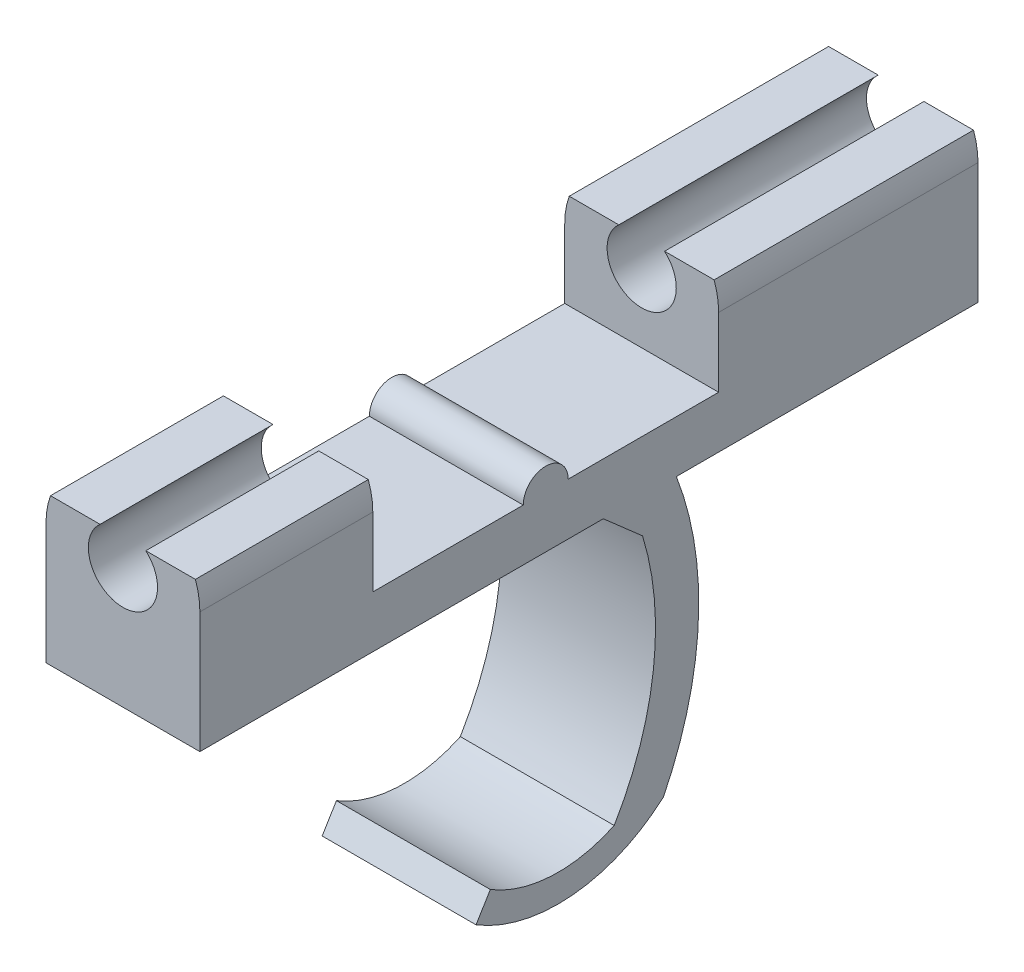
ISO-10303-21;
HEADER;
FILE_DESCRIPTION(('STEP AP214'),'2;1');
FILE_NAME('part.step','',(''),(''),'','','');
FILE_SCHEMA(('AUTOMOTIVE_DESIGN { 1 0 10303 214 1 1 1 1 }'));
ENDSEC;
DATA;
#1=APPLICATION_CONTEXT('core data for automotive mechanical design processes');
#2=APPLICATION_PROTOCOL_DEFINITION('international standard','automotive_design',2000,#1);
#3=PRODUCT_CONTEXT('',#1,'mechanical');
#4=PRODUCT('Part','Part','',(#3));
#5=PRODUCT_RELATED_PRODUCT_CATEGORY('part','',(#4));
#6=PRODUCT_DEFINITION_FORMATION('','',#4);
#7=PRODUCT_DEFINITION_CONTEXT('part definition',#1,'design');
#8=PRODUCT_DEFINITION('design','',#6,#7);
#9=PRODUCT_DEFINITION_SHAPE('','',#8);
#10=(LENGTH_UNIT() NAMED_UNIT(*) SI_UNIT(.MILLI.,.METRE.));
#11=(NAMED_UNIT(*) PLANE_ANGLE_UNIT() SI_UNIT($,.RADIAN.));
#12=(NAMED_UNIT(*) SI_UNIT($,.STERADIAN.) SOLID_ANGLE_UNIT());
#13=UNCERTAINTY_MEASURE_WITH_UNIT(LENGTH_MEASURE(1.E-05),#10,'distance_accuracy_value','');
#14=(GEOMETRIC_REPRESENTATION_CONTEXT(3) GLOBAL_UNCERTAINTY_ASSIGNED_CONTEXT((#13)) GLOBAL_UNIT_ASSIGNED_CONTEXT((#10,
#11,#12)) REPRESENTATION_CONTEXT('',''));
#15=CARTESIAN_POINT('',(0.,0.,0.));
#16=DIRECTION('',(0.,0.,1.));
#17=DIRECTION('',(1.,0.,0.));
#18=AXIS2_PLACEMENT_3D('',#15,#16,#17);
#19=CARTESIAN_POINT('',(-4.45,1.3,45.));
#20=DIRECTION('',(0.,-1.,0.));
#21=DIRECTION('',(0.,0.,-1.));
#22=AXIS2_PLACEMENT_3D('',#19,#20,#21);
#23=PLANE('',#22);
#24=DIRECTION('',(1.,0.,0.));
#25=VECTOR('',#24,1.);
#26=CARTESIAN_POINT('',(-4.45,1.3,15.));
#27=LINE('',#26,#25);
#28=CARTESIAN_POINT('',(-4.45,1.3,15.));
#29=VERTEX_POINT('',#28);
#30=CARTESIAN_POINT('',(4.45,1.3,15.));
#31=VERTEX_POINT('',#30);
#32=EDGE_CURVE('E294',#29,#31,#27,.T.);
#33=ORIENTED_EDGE('',*,*,#32,.F.);
#34=DIRECTION('',(0.,0.,-1.));
#35=VECTOR('',#34,1.);
#36=CARTESIAN_POINT('',(-4.45,1.3,45.));
#37=LINE('',#36,#35);
#38=CARTESIAN_POINT('',(-4.45,1.3,23.7));
#39=VERTEX_POINT('',#38);
#40=EDGE_CURVE('E217',#39,#29,#37,.T.);
#41=ORIENTED_EDGE('',*,*,#40,.F.);
#42=DIRECTION('',(1.,0.,0.));
#43=VECTOR('',#42,1.);
#44=CARTESIAN_POINT('',(-8.12695526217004,1.3,23.7));
#45=LINE('',#44,#43);
#46=CARTESIAN_POINT('',(4.45,1.3,23.7));
#47=VERTEX_POINT('',#46);
#48=EDGE_CURVE('E374',#39,#47,#45,.T.);
#49=ORIENTED_EDGE('',*,*,#48,.T.);
#50=DIRECTION('',(0.,0.,-1.));
#51=VECTOR('',#50,1.);
#52=CARTESIAN_POINT('',(4.45,1.3,45.));
#53=LINE('',#52,#51);
#54=EDGE_CURVE('E383',#47,#31,#53,.T.);
#55=ORIENTED_EDGE('',*,*,#54,.T.);
#56=EDGE_LOOP('',(#33,#41,#49,#55));
#57=FACE_BOUND('',#56,.T.);
#58=ADVANCED_FACE('F43',(#57),#23,.F.);
#59=DIRECTION('',(-1.,0.,0.));
#60=VECTOR('',#59,1.);
#61=CARTESIAN_POINT('',(-4.45,1.3,35.));
#62=LINE('',#61,#60);
#63=CARTESIAN_POINT('',(4.45,1.3,35.));
#64=VERTEX_POINT('',#63);
#65=CARTESIAN_POINT('',(-4.45,1.3,35.));
#66=VERTEX_POINT('',#65);
#67=EDGE_CURVE('E332',#64,#66,#62,.T.);
#68=ORIENTED_EDGE('',*,*,#67,.F.);
#69=CARTESIAN_POINT('',(4.45,1.3,26.3));
#70=VERTEX_POINT('',#69);
#71=EDGE_CURVE('E51',#64,#70,#53,.T.);
#72=ORIENTED_EDGE('',*,*,#71,.T.);
#73=DIRECTION('',(1.,0.,0.));
#74=VECTOR('',#73,1.);
#75=CARTESIAN_POINT('',(-8.12695526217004,1.3,26.3));
#76=LINE('',#75,#74);
#77=CARTESIAN_POINT('',(-4.45,1.3,26.3));
#78=VERTEX_POINT('',#77);
#79=EDGE_CURVE('E371',#70,#78,#76,.F.);
#80=ORIENTED_EDGE('',*,*,#79,.T.);
#81=EDGE_CURVE('E382',#66,#78,#37,.T.);
#82=ORIENTED_EDGE('',*,*,#81,.F.);
#83=EDGE_LOOP('',(#68,#72,#80,#82));
#84=FACE_BOUND('',#83,.T.);
#85=ADVANCED_FACE('F412',(#84),#23,.F.);
#86=CARTESIAN_POINT('',(4.45,1.3,45.));
#87=DIRECTION('',(-1.,0.,0.));
#88=DIRECTION('',(0.,0.,1.));
#89=AXIS2_PLACEMENT_3D('',#86,#87,#88);
#90=PLANE('',#89);
#91=CARTESIAN_POINT('',(4.45,-8.68882702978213,35.65));
#92=DIRECTION('',(1.,0.,0.));
#93=DIRECTION('',(0.,0.,-1.));
#94=AXIS2_PLACEMENT_3D('',#91,#92,#93);
#95=CIRCLE('',#94,19.5);
#96=CARTESIAN_POINT('',(4.45,-17.3776540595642,18.1927870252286));
#97=VERTEX_POINT('',#96);
#98=CARTESIAN_POINT('',(4.45,-1.7,17.4454319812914));
#99=VERTEX_POINT('',#98);
#100=EDGE_CURVE('E346',#97,#99,#95,.T.);
#101=ORIENTED_EDGE('',*,*,#100,.T.);
#102=DIRECTION('',(0.,0.,1.));
#103=VECTOR('',#102,1.);
#104=CARTESIAN_POINT('',(4.45,-1.7,0.));
#105=LINE('',#104,#103);
#106=CARTESIAN_POINT('',(4.45,-1.7,0.));
#107=VERTEX_POINT('',#106);
#108=EDGE_CURVE('E236',#107,#99,#105,.T.);
#109=ORIENTED_EDGE('',*,*,#108,.F.);
#110=DIRECTION('',(0.,1.,0.));
#111=VECTOR('',#110,1.);
#112=CARTESIAN_POINT('',(4.45,1.3,0.));
#113=LINE('',#112,#111);
#114=CARTESIAN_POINT('',(4.45,5.3,0.));
#115=VERTEX_POINT('',#114);
#116=EDGE_CURVE('E377',#107,#115,#113,.T.);
#117=ORIENTED_EDGE('',*,*,#116,.T.);
#118=DIRECTION('',(0.,0.,-1.));
#119=VECTOR('',#118,1.);
#120=CARTESIAN_POINT('',(4.45,5.3,15.));
#121=LINE('',#120,#119);
#122=CARTESIAN_POINT('',(4.45,5.3,15.));
#123=VERTEX_POINT('',#122);
#124=EDGE_CURVE('E291',#123,#115,#121,.T.);
#125=ORIENTED_EDGE('',*,*,#124,.F.);
#126=DIRECTION('',(0.,1.,0.));
#127=VECTOR('',#126,1.);
#128=CARTESIAN_POINT('',(4.45,0.,15.));
#129=LINE('',#128,#127);
#130=EDGE_CURVE('E288',#31,#123,#129,.T.);
#131=ORIENTED_EDGE('',*,*,#130,.F.);
#132=ORIENTED_EDGE('',*,*,#54,.F.);
#133=CARTESIAN_POINT('',(4.45,1.3,25.));
#134=DIRECTION('',(1.,0.,0.));
#135=DIRECTION('',(0.,0.,-1.));
#136=AXIS2_PLACEMENT_3D('',#133,#134,#135);
#137=CIRCLE('',#136,1.3);
#138=EDGE_CURVE('E366',#47,#70,#137,.T.);
#139=ORIENTED_EDGE('',*,*,#138,.T.);
#140=ORIENTED_EDGE('',*,*,#71,.F.);
#141=DIRECTION('',(0.,1.,0.));
#142=VECTOR('',#141,1.);
#143=CARTESIAN_POINT('',(4.45,0.,35.));
#144=LINE('',#143,#142);
#145=CARTESIAN_POINT('',(4.45,5.3,35.));
#146=VERTEX_POINT('',#145);
#147=EDGE_CURVE('E307',#64,#146,#144,.T.);
#148=ORIENTED_EDGE('',*,*,#147,.T.);
#149=DIRECTION('',(0.,0.,1.));
#150=VECTOR('',#149,1.);
#151=CARTESIAN_POINT('',(4.45,5.3,35.));
#152=LINE('',#151,#150);
#153=CARTESIAN_POINT('',(4.45,5.3,45.));
#154=VERTEX_POINT('',#153);
#155=EDGE_CURVE('E321',#146,#154,#152,.T.);
#156=ORIENTED_EDGE('',*,*,#155,.T.);
#157=DIRECTION('',(0.,1.,0.));
#158=VECTOR('',#157,1.);
#159=CARTESIAN_POINT('',(4.45,1.3,45.));
#160=LINE('',#159,#158);
#161=CARTESIAN_POINT('',(4.45,-1.7,45.));
#162=VERTEX_POINT('',#161);
#163=EDGE_CURVE('E218',#162,#154,#160,.T.);
#164=ORIENTED_EDGE('',*,*,#163,.F.);
#165=CARTESIAN_POINT('',(4.45,-1.7,21.6701921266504));
#166=VERTEX_POINT('',#165);
#167=EDGE_CURVE('E230',#166,#162,#105,.T.);
#168=ORIENTED_EDGE('',*,*,#167,.F.);
#169=DIRECTION('',(0.,0.659518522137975,0.751688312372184));
#170=VECTOR('',#169,1.);
#171=CARTESIAN_POINT('',(4.45,-11.7036090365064,10.2685472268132));
#172=LINE('',#171,#170);
#173=CARTESIAN_POINT('',(4.45,-3.6906262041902,19.401369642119));
#174=VERTEX_POINT('',#173);
#175=EDGE_CURVE('E353',#174,#166,#172,.T.);
#176=ORIENTED_EDGE('',*,*,#175,.F.);
#177=CARTESIAN_POINT('',(4.45,-8.68882702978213,35.65));
#178=DIRECTION('',(1.,0.,0.));
#179=DIRECTION('',(0.,0.,-1.));
#180=AXIS2_PLACEMENT_3D('',#177,#178,#179);
#181=CIRCLE('',#180,17.);
#182=CARTESIAN_POINT('',(4.45,-17.3776540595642,21.0382141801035));
#183=VERTEX_POINT('',#182);
#184=EDGE_CURVE('E356',#183,#174,#181,.T.);
#185=ORIENTED_EDGE('',*,*,#184,.F.);
#186=CARTESIAN_POINT('',(4.45,-10.556501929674,24.2732126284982));
#187=DIRECTION('',(1.,0.,0.));
#188=DIRECTION('',(0.,0.,-1.));
#189=AXIS2_PLACEMENT_3D('',#186,#187,#188);
#190=CIRCLE('',#189,7.5493927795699);
#191=CARTESIAN_POINT('',(4.45,-17.0023963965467,28.2030696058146));
#192=VERTEX_POINT('',#191);
#193=EDGE_CURVE('E269',#192,#183,#190,.T.);
#194=ORIENTED_EDGE('',*,*,#193,.F.);
#195=DIRECTION('',(0.,-0.853829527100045,0.520552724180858));
#196=VECTOR('',#195,1.);
#197=CARTESIAN_POINT('',(4.45,7.92800228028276,13.0037979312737));
#198=LINE('',#197,#196);
#199=CARTESIAN_POINT('',(4.45,-18.3586395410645,29.0299279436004));
#200=VERTEX_POINT('',#199);
#201=EDGE_CURVE('E245',#192,#200,#198,.T.);
#202=ORIENTED_EDGE('',*,*,#201,.T.);
#203=CARTESIAN_POINT('',(4.45,-10.556501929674,24.2732126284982));
#204=DIRECTION('',(1.,0.,0.));
#205=DIRECTION('',(0.,0.,-1.));
#206=AXIS2_PLACEMENT_3D('',#203,#204,#205);
#207=CIRCLE('',#206,9.13781658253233);
#208=EDGE_CURVE('E266',#200,#97,#207,.T.);
#209=ORIENTED_EDGE('',*,*,#208,.T.);
#210=EDGE_LOOP('',(#101,#109,#117,#125,#131,#132,#139,#140,#148,#156,#164,#168,#176,#185,#194,
#202,#209));
#211=FACE_BOUND('',#210,.T.);
#212=ADVANCED_FACE('F45',(#211),#90,.F.);
#213=CARTESIAN_POINT('',(-4.45,0.,45.));
#214=DIRECTION('',(1.,0.,0.));
#215=DIRECTION('',(0.,0.,-1.));
#216=AXIS2_PLACEMENT_3D('',#213,#214,#215);
#217=PLANE('',#216);
#218=DIRECTION('',(0.,-0.659518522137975,-0.751688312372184));
#219=VECTOR('',#218,1.);
#220=CARTESIAN_POINT('',(-4.45,-11.7036090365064,10.2685472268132));
#221=LINE('',#220,#219);
#222=CARTESIAN_POINT('',(-4.45,-1.7,21.6701921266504));
#223=VERTEX_POINT('',#222);
#224=CARTESIAN_POINT('',(-4.45,-3.6906262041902,19.401369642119));
#225=VERTEX_POINT('',#224);
#226=EDGE_CURVE('E223',#223,#225,#221,.T.);
#227=ORIENTED_EDGE('',*,*,#226,.F.);
#228=DIRECTION('',(0.,0.,-1.));
#229=VECTOR('',#228,1.);
#230=CARTESIAN_POINT('',(-4.45,-1.7,45.));
#231=LINE('',#230,#229);
#232=CARTESIAN_POINT('',(-4.45,-1.7,45.));
#233=VERTEX_POINT('',#232);
#234=EDGE_CURVE('E58',#233,#223,#231,.T.);
#235=ORIENTED_EDGE('',*,*,#234,.F.);
#236=DIRECTION('',(0.,-1.,0.));
#237=VECTOR('',#236,1.);
#238=CARTESIAN_POINT('',(-4.45,0.,45.));
#239=LINE('',#238,#237);
#240=CARTESIAN_POINT('',(-4.45,5.3,45.));
#241=VERTEX_POINT('',#240);
#242=EDGE_CURVE('E209',#241,#233,#239,.T.);
#243=ORIENTED_EDGE('',*,*,#242,.F.);
#244=DIRECTION('',(0.,0.,1.));
#245=VECTOR('',#244,1.);
#246=CARTESIAN_POINT('',(-4.45,5.3,35.));
#247=LINE('',#246,#245);
#248=CARTESIAN_POINT('',(-4.45,5.3,35.));
#249=VERTEX_POINT('',#248);
#250=EDGE_CURVE('E330',#249,#241,#247,.T.);
#251=ORIENTED_EDGE('',*,*,#250,.F.);
#252=DIRECTION('',(0.,-1.,0.));
#253=VECTOR('',#252,1.);
#254=CARTESIAN_POINT('',(-4.45,0.,35.));
#255=LINE('',#254,#253);
#256=EDGE_CURVE('E318',#249,#66,#255,.T.);
#257=ORIENTED_EDGE('',*,*,#256,.T.);
#258=ORIENTED_EDGE('',*,*,#81,.T.);
#259=CARTESIAN_POINT('',(-4.45,1.3,25.));
#260=DIRECTION('',(1.,0.,0.));
#261=DIRECTION('',(0.,0.,-1.));
#262=AXIS2_PLACEMENT_3D('',#259,#260,#261);
#263=CIRCLE('',#262,1.3);
#264=EDGE_CURVE('E369',#78,#39,#263,.F.);
#265=ORIENTED_EDGE('',*,*,#264,.T.);
#266=ORIENTED_EDGE('',*,*,#40,.T.);
#267=DIRECTION('',(0.,-1.,0.));
#268=VECTOR('',#267,1.);
#269=CARTESIAN_POINT('',(-4.45,0.,15.));
#270=LINE('',#269,#268);
#271=CARTESIAN_POINT('',(-4.45,5.3,15.));
#272=VERTEX_POINT('',#271);
#273=EDGE_CURVE('E276',#272,#29,#270,.T.);
#274=ORIENTED_EDGE('',*,*,#273,.F.);
#275=DIRECTION('',(0.,0.,-1.));
#276=VECTOR('',#275,1.);
#277=CARTESIAN_POINT('',(-4.45,5.3,15.));
#278=LINE('',#277,#276);
#279=CARTESIAN_POINT('',(-4.45,5.3,0.));
#280=VERTEX_POINT('',#279);
#281=EDGE_CURVE('E290',#272,#280,#278,.T.);
#282=ORIENTED_EDGE('',*,*,#281,.T.);
#283=DIRECTION('',(0.,-1.,0.));
#284=VECTOR('',#283,1.);
#285=CARTESIAN_POINT('',(-4.45,0.,0.));
#286=LINE('',#285,#284);
#287=CARTESIAN_POINT('',(-4.45,-1.7,0.));
#288=VERTEX_POINT('',#287);
#289=EDGE_CURVE('E378',#280,#288,#286,.T.);
#290=ORIENTED_EDGE('',*,*,#289,.T.);
#291=CARTESIAN_POINT('',(-4.45,-1.7,17.4454319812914));
#292=VERTEX_POINT('',#291);
#293=EDGE_CURVE('E225',#292,#288,#231,.T.);
#294=ORIENTED_EDGE('',*,*,#293,.F.);
#295=CARTESIAN_POINT('',(-4.45,-8.68882702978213,35.65));
#296=DIRECTION('',(1.,0.,0.));
#297=DIRECTION('',(0.,0.,-1.));
#298=AXIS2_PLACEMENT_3D('',#295,#296,#297);
#299=CIRCLE('',#298,19.5);
#300=CARTESIAN_POINT('',(-4.45,-17.3776540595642,18.1927870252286));
#301=VERTEX_POINT('',#300);
#302=EDGE_CURVE('E351',#292,#301,#299,.F.);
#303=ORIENTED_EDGE('',*,*,#302,.T.);
#304=CARTESIAN_POINT('',(-4.45,-10.556501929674,24.2732126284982));
#305=DIRECTION('',(1.,0.,0.));
#306=DIRECTION('',(0.,0.,-1.));
#307=AXIS2_PLACEMENT_3D('',#304,#305,#306);
#308=CIRCLE('',#307,9.13781658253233);
#309=CARTESIAN_POINT('',(-4.45,-18.3586395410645,29.0299279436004));
#310=VERTEX_POINT('',#309);
#311=EDGE_CURVE('E263',#301,#310,#308,.F.);
#312=ORIENTED_EDGE('',*,*,#311,.T.);
#313=DIRECTION('',(0.,0.853829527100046,-0.520552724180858));
#314=VECTOR('',#313,1.);
#315=CARTESIAN_POINT('',(-4.45,7.92800228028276,13.0037979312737));
#316=LINE('',#315,#314);
#317=CARTESIAN_POINT('',(-4.45,-17.0023963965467,28.2030696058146));
#318=VERTEX_POINT('',#317);
#319=EDGE_CURVE('E260',#310,#318,#316,.T.);
#320=ORIENTED_EDGE('',*,*,#319,.T.);
#321=CARTESIAN_POINT('',(-4.45,-10.556501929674,24.2732126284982));
#322=DIRECTION('',(1.,0.,0.));
#323=DIRECTION('',(0.,0.,-1.));
#324=AXIS2_PLACEMENT_3D('',#321,#322,#323);
#325=CIRCLE('',#324,7.5493927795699);
#326=CARTESIAN_POINT('',(-4.45,-17.3776540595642,21.0382141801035));
#327=VERTEX_POINT('',#326);
#328=EDGE_CURVE('E257',#327,#318,#325,.F.);
#329=ORIENTED_EDGE('',*,*,#328,.F.);
#330=CARTESIAN_POINT('',(-4.45,-8.68882702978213,35.65));
#331=DIRECTION('',(1.,0.,0.));
#332=DIRECTION('',(0.,0.,-1.));
#333=AXIS2_PLACEMENT_3D('',#330,#331,#332);
#334=CIRCLE('',#333,17.);
#335=EDGE_CURVE('E348',#225,#327,#334,.F.);
#336=ORIENTED_EDGE('',*,*,#335,.F.);
#337=EDGE_LOOP('',(#227,#235,#243,#251,#257,#258,#265,#266,#274,#282,#290,#294,#303,#312,#320,
#329,#336));
#338=FACE_BOUND('',#337,.T.);
#339=ADVANCED_FACE('F221',(#338),#217,.F.);
#340=CARTESIAN_POINT('',(0.,0.,45.));
#341=DIRECTION('',(0.,0.,-1.));
#342=DIRECTION('',(-1.,0.,0.));
#343=AXIS2_PLACEMENT_3D('',#340,#341,#342);
#344=PLANE('',#343);
#345=ORIENTED_EDGE('',*,*,#163,.T.);
#346=CARTESIAN_POINT('',(0.,5.3,45.));
#347=DIRECTION('',(0.,0.,1.));
#348=DIRECTION('',(1.,0.,0.));
#349=AXIS2_PLACEMENT_3D('',#346,#347,#348);
#350=CIRCLE('',#349,4.45);
#351=CARTESIAN_POINT('',(4.18957038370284,6.8,45.));
#352=VERTEX_POINT('',#351);
#353=EDGE_CURVE('E306',#154,#352,#350,.T.);
#354=ORIENTED_EDGE('',*,*,#353,.T.);
#355=DIRECTION('',(1.,0.,0.));
#356=VECTOR('',#355,1.);
#357=CARTESIAN_POINT('',(0.,6.8,45.));
#358=LINE('',#357,#356);
#359=CARTESIAN_POINT('',(1.3228756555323,6.8,45.));
#360=VERTEX_POINT('',#359);
#361=EDGE_CURVE('E324',#360,#352,#358,.T.);
#362=ORIENTED_EDGE('',*,*,#361,.F.);
#363=CARTESIAN_POINT('',(0.,5.3,45.));
#364=DIRECTION('',(0.,0.,1.));
#365=DIRECTION('',(1.,0.,0.));
#366=AXIS2_PLACEMENT_3D('',#363,#364,#365);
#367=CIRCLE('',#366,2.);
#368=CARTESIAN_POINT('',(-1.3228756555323,6.8,45.));
#369=VERTEX_POINT('',#368);
#370=EDGE_CURVE('E327',#369,#360,#367,.T.);
#371=ORIENTED_EDGE('',*,*,#370,.F.);
#372=CARTESIAN_POINT('',(-4.18957038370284,6.8,45.));
#373=VERTEX_POINT('',#372);
#374=EDGE_CURVE('E328',#373,#369,#358,.T.);
#375=ORIENTED_EDGE('',*,*,#374,.F.);
#376=EDGE_CURVE('E214',#373,#241,#350,.T.);
#377=ORIENTED_EDGE('',*,*,#376,.T.);
#378=ORIENTED_EDGE('',*,*,#242,.T.);
#379=DIRECTION('',(-1.,0.,0.));
#380=VECTOR('',#379,1.);
#381=CARTESIAN_POINT('',(4.45,-1.7,45.));
#382=LINE('',#381,#380);
#383=EDGE_CURVE('E211',#162,#233,#382,.T.);
#384=ORIENTED_EDGE('',*,*,#383,.F.);
#385=EDGE_LOOP('',(#345,#354,#362,#371,#375,#377,#378,#384));
#386=FACE_BOUND('',#385,.T.);
#387=ADVANCED_FACE('F210',(#386),#344,.F.);
#388=CARTESIAN_POINT('',(0.,0.,0.));
#389=DIRECTION('',(0.,0.,-1.));
#390=DIRECTION('',(-1.,0.,0.));
#391=AXIS2_PLACEMENT_3D('',#388,#389,#390);
#392=PLANE('',#391);
#393=ORIENTED_EDGE('',*,*,#116,.F.);
#394=DIRECTION('',(1.,0.,0.));
#395=VECTOR('',#394,1.);
#396=CARTESIAN_POINT('',(-4.45,-1.7,0.));
#397=LINE('',#396,#395);
#398=EDGE_CURVE('E224',#288,#107,#397,.T.);
#399=ORIENTED_EDGE('',*,*,#398,.F.);
#400=ORIENTED_EDGE('',*,*,#289,.F.);
#401=CARTESIAN_POINT('',(0.,5.3,0.));
#402=DIRECTION('',(0.,0.,-1.));
#403=DIRECTION('',(-1.,0.,0.));
#404=AXIS2_PLACEMENT_3D('',#401,#402,#403);
#405=CIRCLE('',#404,4.45);
#406=CARTESIAN_POINT('',(-4.18957038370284,6.8,0.));
#407=VERTEX_POINT('',#406);
#408=EDGE_CURVE('E252',#280,#407,#405,.T.);
#409=ORIENTED_EDGE('',*,*,#408,.T.);
#410=DIRECTION('',(1.,0.,0.));
#411=VECTOR('',#410,1.);
#412=CARTESIAN_POINT('',(-4.18957038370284,6.8,0.));
#413=LINE('',#412,#411);
#414=CARTESIAN_POINT('',(-1.3228756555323,6.8,0.));
#415=VERTEX_POINT('',#414);
#416=EDGE_CURVE('E249',#407,#415,#413,.T.);
#417=ORIENTED_EDGE('',*,*,#416,.T.);
#418=CARTESIAN_POINT('',(0.,5.3,0.));
#419=DIRECTION('',(0.,0.,-1.));
#420=DIRECTION('',(-1.,0.,0.));
#421=AXIS2_PLACEMENT_3D('',#418,#419,#420);
#422=CIRCLE('',#421,2.);
#423=CARTESIAN_POINT('',(1.3228756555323,6.8,0.));
#424=VERTEX_POINT('',#423);
#425=EDGE_CURVE('E246',#415,#424,#422,.F.);
#426=ORIENTED_EDGE('',*,*,#425,.T.);
#427=DIRECTION('',(1.,0.,0.));
#428=VECTOR('',#427,1.);
#429=CARTESIAN_POINT('',(1.3228756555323,6.8,0.));
#430=LINE('',#429,#428);
#431=CARTESIAN_POINT('',(4.18957038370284,6.8,0.));
#432=VERTEX_POINT('',#431);
#433=EDGE_CURVE('E242',#424,#432,#430,.T.);
#434=ORIENTED_EDGE('',*,*,#433,.T.);
#435=CARTESIAN_POINT('',(0.,5.3,0.));
#436=DIRECTION('',(0.,0.,-1.));
#437=DIRECTION('',(-1.,0.,0.));
#438=AXIS2_PLACEMENT_3D('',#435,#436,#437);
#439=CIRCLE('',#438,4.45);
#440=EDGE_CURVE('E241',#432,#115,#439,.T.);
#441=ORIENTED_EDGE('',*,*,#440,.T.);
#442=EDGE_LOOP('',(#393,#399,#400,#409,#417,#426,#434,#441));
#443=FACE_BOUND('',#442,.T.);
#444=ADVANCED_FACE('F459',(#443),#392,.T.);
#445=CARTESIAN_POINT('',(-8.12695526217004,1.3,25.));
#446=DIRECTION('',(1.,0.,0.));
#447=DIRECTION('',(0.,0.,-1.));
#448=AXIS2_PLACEMENT_3D('',#445,#446,#447);
#449=CYLINDRICAL_SURFACE('',#448,1.3);
#450=ORIENTED_EDGE('',*,*,#48,.F.);
#451=ORIENTED_EDGE('',*,*,#264,.F.);
#452=ORIENTED_EDGE('',*,*,#79,.F.);
#453=ORIENTED_EDGE('',*,*,#138,.F.);
#454=EDGE_LOOP('',(#450,#451,#452,#453));
#455=FACE_BOUND('',#454,.T.);
#456=ADVANCED_FACE('F411',(#455),#449,.T.);
#457=CARTESIAN_POINT('',(-23.3603471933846,-8.68882702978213,35.65));
#458=DIRECTION('',(1.,0.,0.));
#459=DIRECTION('',(0.,0.,-1.));
#460=AXIS2_PLACEMENT_3D('',#457,#458,#459);
#461=CYLINDRICAL_SURFACE('',#460,17.);
#462=DIRECTION('',(1.,0.,0.));
#463=VECTOR('',#462,1.);
#464=CARTESIAN_POINT('',(-23.3603471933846,-3.6906262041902,19.401369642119));
#465=LINE('',#464,#463);
#466=EDGE_CURVE('E361',#225,#174,#465,.T.);
#467=ORIENTED_EDGE('',*,*,#466,.F.);
#468=ORIENTED_EDGE('',*,*,#335,.T.);
#469=DIRECTION('',(1.,0.,0.));
#470=VECTOR('',#469,1.);
#471=CARTESIAN_POINT('',(-23.3603471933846,-17.3776540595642,21.0382141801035));
#472=LINE('',#471,#470);
#473=EDGE_CURVE('E349',#327,#183,#472,.T.);
#474=ORIENTED_EDGE('',*,*,#473,.T.);
#475=ORIENTED_EDGE('',*,*,#184,.T.);
#476=EDGE_LOOP('',(#467,#468,#474,#475));
#477=FACE_BOUND('',#476,.T.);
#478=ADVANCED_FACE('F435',(#477),#461,.F.);
#479=CARTESIAN_POINT('',(-23.3603471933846,-11.7036090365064,10.2685472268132));
#480=DIRECTION('',(0.,0.751688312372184,-0.659518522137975));
#481=DIRECTION('',(0.,0.659518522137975,0.751688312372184));
#482=AXIS2_PLACEMENT_3D('',#479,#480,#481);
#483=PLANE('',#482);
#484=ORIENTED_EDGE('',*,*,#175,.T.);
#485=DIRECTION('',(-1.,0.,0.));
#486=VECTOR('',#485,1.);
#487=CARTESIAN_POINT('',(-23.3603471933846,-1.7,21.6701921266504));
#488=LINE('',#487,#486);
#489=EDGE_CURVE('E239',#166,#223,#488,.T.);
#490=ORIENTED_EDGE('',*,*,#489,.T.);
#491=ORIENTED_EDGE('',*,*,#226,.T.);
#492=ORIENTED_EDGE('',*,*,#466,.T.);
#493=EDGE_LOOP('',(#484,#490,#491,#492));
#494=FACE_BOUND('',#493,.T.);
#495=ADVANCED_FACE('F432',(#494),#483,.F.);
#496=CARTESIAN_POINT('',(-23.3603471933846,-8.68882702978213,35.65));
#497=DIRECTION('',(1.,0.,0.));
#498=DIRECTION('',(0.,0.,-1.));
#499=AXIS2_PLACEMENT_3D('',#496,#497,#498);
#500=CYLINDRICAL_SURFACE('',#499,19.5);
#501=DIRECTION('',(1.,0.,0.));
#502=VECTOR('',#501,1.);
#503=CARTESIAN_POINT('',(-23.3603471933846,-1.7,17.4454319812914));
#504=LINE('',#503,#502);
#505=EDGE_CURVE('E11',#99,#292,#504,.F.);
#506=ORIENTED_EDGE('',*,*,#505,.F.);
#507=ORIENTED_EDGE('',*,*,#100,.F.);
#508=DIRECTION('',(1.,0.,0.));
#509=VECTOR('',#508,1.);
#510=CARTESIAN_POINT('',(-23.3603471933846,-17.3776540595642,18.1927870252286));
#511=LINE('',#510,#509);
#512=EDGE_CURVE('E359',#301,#97,#511,.T.);
#513=ORIENTED_EDGE('',*,*,#512,.F.);
#514=ORIENTED_EDGE('',*,*,#302,.F.);
#515=EDGE_LOOP('',(#506,#507,#513,#514));
#516=FACE_BOUND('',#515,.T.);
#517=ADVANCED_FACE('F453',(#516),#500,.T.);
#518=CARTESIAN_POINT('',(0.,0.,35.));
#519=DIRECTION('',(0.,0.,1.));
#520=DIRECTION('',(1.,0.,0.));
#521=AXIS2_PLACEMENT_3D('',#518,#519,#520);
#522=PLANE('',#521);
#523=ORIENTED_EDGE('',*,*,#147,.F.);
#524=ORIENTED_EDGE('',*,*,#67,.T.);
#525=ORIENTED_EDGE('',*,*,#256,.F.);
#526=CARTESIAN_POINT('',(0.,5.3,35.));
#527=DIRECTION('',(0.,0.,1.));
#528=DIRECTION('',(1.,0.,0.));
#529=AXIS2_PLACEMENT_3D('',#526,#527,#528);
#530=CIRCLE('',#529,4.45);
#531=CARTESIAN_POINT('',(-4.18957038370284,6.8,35.));
#532=VERTEX_POINT('',#531);
#533=EDGE_CURVE('E313',#532,#249,#530,.T.);
#534=ORIENTED_EDGE('',*,*,#533,.F.);
#535=DIRECTION('',(1.,0.,0.));
#536=VECTOR('',#535,1.);
#537=CARTESIAN_POINT('',(0.,6.8,35.));
#538=LINE('',#537,#536);
#539=CARTESIAN_POINT('',(-1.3228756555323,6.8,35.));
#540=VERTEX_POINT('',#539);
#541=EDGE_CURVE('E316',#532,#540,#538,.T.);
#542=ORIENTED_EDGE('',*,*,#541,.T.);
#543=CARTESIAN_POINT('',(0.,5.3,35.));
#544=DIRECTION('',(0.,0.,1.));
#545=DIRECTION('',(1.,0.,0.));
#546=AXIS2_PLACEMENT_3D('',#543,#544,#545);
#547=CIRCLE('',#546,2.);
#548=CARTESIAN_POINT('',(1.3228756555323,6.8,35.));
#549=VERTEX_POINT('',#548);
#550=EDGE_CURVE('E315',#540,#549,#547,.T.);
#551=ORIENTED_EDGE('',*,*,#550,.T.);
#552=CARTESIAN_POINT('',(4.18957038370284,6.8,35.));
#553=VERTEX_POINT('',#552);
#554=EDGE_CURVE('E312',#549,#553,#538,.T.);
#555=ORIENTED_EDGE('',*,*,#554,.T.);
#556=EDGE_CURVE('E309',#146,#553,#530,.T.);
#557=ORIENTED_EDGE('',*,*,#556,.F.);
#558=EDGE_LOOP('',(#523,#524,#525,#534,#542,#551,#555,#557));
#559=FACE_BOUND('',#558,.T.);
#560=ADVANCED_FACE('F420',(#559),#522,.F.);
#561=CARTESIAN_POINT('',(0.,5.3,35.));
#562=DIRECTION('',(0.,0.,1.));
#563=DIRECTION('',(1.,0.,0.));
#564=AXIS2_PLACEMENT_3D('',#561,#562,#563);
#565=CYLINDRICAL_SURFACE('',#564,4.45);
#566=ORIENTED_EDGE('',*,*,#376,.F.);
#567=DIRECTION('',(0.,0.,1.));
#568=VECTOR('',#567,1.);
#569=CARTESIAN_POINT('',(-4.18957038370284,6.8,35.));
#570=LINE('',#569,#568);
#571=EDGE_CURVE('E333',#532,#373,#570,.T.);
#572=ORIENTED_EDGE('',*,*,#571,.F.);
#573=ORIENTED_EDGE('',*,*,#533,.T.);
#574=ORIENTED_EDGE('',*,*,#250,.T.);
#575=EDGE_LOOP('',(#566,#572,#573,#574));
#576=FACE_BOUND('',#575,.T.);
#577=ADVANCED_FACE('F512',(#576),#565,.T.);
#578=CARTESIAN_POINT('',(0.,6.8,35.));
#579=DIRECTION('',(0.,-1.,0.));
#580=DIRECTION('',(0.,0.,-1.));
#581=AXIS2_PLACEMENT_3D('',#578,#579,#580);
#582=PLANE('',#581);
#583=ORIENTED_EDGE('',*,*,#374,.T.);
#584=DIRECTION('',(0.,0.,1.));
#585=VECTOR('',#584,1.);
#586=CARTESIAN_POINT('',(-1.3228756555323,6.8,35.));
#587=LINE('',#586,#585);
#588=EDGE_CURVE('E335',#540,#369,#587,.T.);
#589=ORIENTED_EDGE('',*,*,#588,.F.);
#590=ORIENTED_EDGE('',*,*,#541,.F.);
#591=ORIENTED_EDGE('',*,*,#571,.T.);
#592=EDGE_LOOP('',(#583,#589,#590,#591));
#593=FACE_BOUND('',#592,.T.);
#594=ADVANCED_FACE('F508',(#593),#582,.F.);
#595=CARTESIAN_POINT('',(0.,5.3,35.));
#596=DIRECTION('',(0.,0.,1.));
#597=DIRECTION('',(1.,0.,0.));
#598=AXIS2_PLACEMENT_3D('',#595,#596,#597);
#599=CYLINDRICAL_SURFACE('',#598,2.);
#600=ORIENTED_EDGE('',*,*,#370,.T.);
#601=DIRECTION('',(0.,0.,1.));
#602=VECTOR('',#601,1.);
#603=CARTESIAN_POINT('',(1.3228756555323,6.8,35.));
#604=LINE('',#603,#602);
#605=EDGE_CURVE('E338',#549,#360,#604,.T.);
#606=ORIENTED_EDGE('',*,*,#605,.F.);
#607=ORIENTED_EDGE('',*,*,#550,.F.);
#608=ORIENTED_EDGE('',*,*,#588,.T.);
#609=EDGE_LOOP('',(#600,#606,#607,#608));
#610=FACE_BOUND('',#609,.T.);
#611=ADVANCED_FACE('F505',(#610),#599,.F.);
#612=ORIENTED_EDGE('',*,*,#361,.T.);
#613=DIRECTION('',(0.,0.,1.));
#614=VECTOR('',#613,1.);
#615=CARTESIAN_POINT('',(4.18957038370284,6.8,35.));
#616=LINE('',#615,#614);
#617=EDGE_CURVE('E341',#553,#352,#616,.T.);
#618=ORIENTED_EDGE('',*,*,#617,.F.);
#619=ORIENTED_EDGE('',*,*,#554,.F.);
#620=ORIENTED_EDGE('',*,*,#605,.T.);
#621=EDGE_LOOP('',(#612,#618,#619,#620));
#622=FACE_BOUND('',#621,.T.);
#623=ADVANCED_FACE('F426',(#622),#582,.F.);
#624=ORIENTED_EDGE('',*,*,#353,.F.);
#625=ORIENTED_EDGE('',*,*,#155,.F.);
#626=ORIENTED_EDGE('',*,*,#556,.T.);
#627=ORIENTED_EDGE('',*,*,#617,.T.);
#628=EDGE_LOOP('',(#624,#625,#626,#627));
#629=FACE_BOUND('',#628,.T.);
#630=ADVANCED_FACE('F419',(#629),#565,.T.);
#631=CARTESIAN_POINT('',(0.,0.,15.));
#632=DIRECTION('',(0.,0.,-1.));
#633=DIRECTION('',(1.,0.,0.));
#634=AXIS2_PLACEMENT_3D('',#631,#632,#633);
#635=PLANE('',#634);
#636=ORIENTED_EDGE('',*,*,#273,.T.);
#637=ORIENTED_EDGE('',*,*,#32,.T.);
#638=ORIENTED_EDGE('',*,*,#130,.T.);
#639=CARTESIAN_POINT('',(0.,5.3,15.));
#640=DIRECTION('',(0.,0.,1.));
#641=DIRECTION('',(1.,0.,0.));
#642=AXIS2_PLACEMENT_3D('',#639,#640,#641);
#643=CIRCLE('',#642,4.45);
#644=CARTESIAN_POINT('',(4.18957038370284,6.8,15.));
#645=VERTEX_POINT('',#644);
#646=EDGE_CURVE('E281',#123,#645,#643,.T.);
#647=ORIENTED_EDGE('',*,*,#646,.T.);
#648=DIRECTION('',(1.,0.,0.));
#649=VECTOR('',#648,1.);
#650=CARTESIAN_POINT('',(0.,6.8,15.));
#651=LINE('',#650,#649);
#652=CARTESIAN_POINT('',(1.3228756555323,6.8,15.));
#653=VERTEX_POINT('',#652);
#654=EDGE_CURVE('E285',#653,#645,#651,.T.);
#655=ORIENTED_EDGE('',*,*,#654,.F.);
#656=CARTESIAN_POINT('',(0.,5.3,15.));
#657=DIRECTION('',(0.,0.,1.));
#658=DIRECTION('',(1.,0.,0.));
#659=AXIS2_PLACEMENT_3D('',#656,#657,#658);
#660=CIRCLE('',#659,2.);
#661=CARTESIAN_POINT('',(-1.3228756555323,6.8,15.));
#662=VERTEX_POINT('',#661);
#663=EDGE_CURVE('E284',#662,#653,#660,.T.);
#664=ORIENTED_EDGE('',*,*,#663,.F.);
#665=CARTESIAN_POINT('',(-4.18957038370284,6.8,15.));
#666=VERTEX_POINT('',#665);
#667=EDGE_CURVE('E280',#666,#662,#651,.T.);
#668=ORIENTED_EDGE('',*,*,#667,.F.);
#669=EDGE_CURVE('E278',#666,#272,#643,.T.);
#670=ORIENTED_EDGE('',*,*,#669,.T.);
#671=EDGE_LOOP('',(#636,#637,#638,#647,#655,#664,#668,#670));
#672=FACE_BOUND('',#671,.T.);
#673=ADVANCED_FACE('F400',(#672),#635,.F.);
#674=CARTESIAN_POINT('',(0.,5.3,15.));
#675=DIRECTION('',(0.,0.,-1.));
#676=DIRECTION('',(-1.,0.,0.));
#677=AXIS2_PLACEMENT_3D('',#674,#675,#676);
#678=CYLINDRICAL_SURFACE('',#677,4.45);
#679=ORIENTED_EDGE('',*,*,#124,.T.);
#680=ORIENTED_EDGE('',*,*,#440,.F.);
#681=DIRECTION('',(0.,0.,-1.));
#682=VECTOR('',#681,1.);
#683=CARTESIAN_POINT('',(4.18957038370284,6.8,15.));
#684=LINE('',#683,#682);
#685=EDGE_CURVE('E295',#645,#432,#684,.T.);
#686=ORIENTED_EDGE('',*,*,#685,.F.);
#687=ORIENTED_EDGE('',*,*,#646,.F.);
#688=EDGE_LOOP('',(#679,#680,#686,#687));
#689=FACE_BOUND('',#688,.T.);
#690=ADVANCED_FACE('F462',(#689),#678,.T.);
#691=CARTESIAN_POINT('',(0.,6.8,15.));
#692=DIRECTION('',(0.,1.,0.));
#693=DIRECTION('',(0.,0.,1.));
#694=AXIS2_PLACEMENT_3D('',#691,#692,#693);
#695=PLANE('',#694);
#696=ORIENTED_EDGE('',*,*,#685,.T.);
#697=ORIENTED_EDGE('',*,*,#433,.F.);
#698=DIRECTION('',(0.,0.,-1.));
#699=VECTOR('',#698,1.);
#700=CARTESIAN_POINT('',(1.3228756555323,6.8,15.));
#701=LINE('',#700,#699);
#702=EDGE_CURVE('E297',#653,#424,#701,.T.);
#703=ORIENTED_EDGE('',*,*,#702,.F.);
#704=ORIENTED_EDGE('',*,*,#654,.T.);
#705=EDGE_LOOP('',(#696,#697,#703,#704));
#706=FACE_BOUND('',#705,.T.);
#707=ADVANCED_FACE('F466',(#706),#695,.T.);
#708=CARTESIAN_POINT('',(0.,5.3,15.));
#709=DIRECTION('',(0.,0.,-1.));
#710=DIRECTION('',(-1.,0.,0.));
#711=AXIS2_PLACEMENT_3D('',#708,#709,#710);
#712=CYLINDRICAL_SURFACE('',#711,2.);
#713=ORIENTED_EDGE('',*,*,#702,.T.);
#714=ORIENTED_EDGE('',*,*,#425,.F.);
#715=DIRECTION('',(0.,0.,-1.));
#716=VECTOR('',#715,1.);
#717=CARTESIAN_POINT('',(-1.3228756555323,6.8,15.));
#718=LINE('',#717,#716);
#719=EDGE_CURVE('E299',#662,#415,#718,.T.);
#720=ORIENTED_EDGE('',*,*,#719,.F.);
#721=ORIENTED_EDGE('',*,*,#663,.T.);
#722=EDGE_LOOP('',(#713,#714,#720,#721));
#723=FACE_BOUND('',#722,.T.);
#724=ADVANCED_FACE('F470',(#723),#712,.F.);
#725=ORIENTED_EDGE('',*,*,#719,.T.);
#726=ORIENTED_EDGE('',*,*,#416,.F.);
#727=DIRECTION('',(0.,0.,-1.));
#728=VECTOR('',#727,1.);
#729=CARTESIAN_POINT('',(-4.18957038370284,6.8,15.));
#730=LINE('',#729,#728);
#731=EDGE_CURVE('E301',#666,#407,#730,.T.);
#732=ORIENTED_EDGE('',*,*,#731,.F.);
#733=ORIENTED_EDGE('',*,*,#667,.T.);
#734=EDGE_LOOP('',(#725,#726,#732,#733));
#735=FACE_BOUND('',#734,.T.);
#736=ADVANCED_FACE('F473',(#735),#695,.T.);
#737=ORIENTED_EDGE('',*,*,#731,.T.);
#738=ORIENTED_EDGE('',*,*,#408,.F.);
#739=ORIENTED_EDGE('',*,*,#281,.F.);
#740=ORIENTED_EDGE('',*,*,#669,.F.);
#741=EDGE_LOOP('',(#737,#738,#739,#740));
#742=FACE_BOUND('',#741,.T.);
#743=ADVANCED_FACE('F475',(#742),#678,.T.);
#744=CARTESIAN_POINT('',(-15.616470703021,7.92800228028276,13.0037979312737));
#745=DIRECTION('',(0.,0.520552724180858,0.853829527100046));
#746=DIRECTION('',(0.,-0.853829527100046,0.520552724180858));
#747=AXIS2_PLACEMENT_3D('',#744,#745,#746);
#748=PLANE('',#747);
#749=ORIENTED_EDGE('',*,*,#319,.F.);
#750=DIRECTION('',(1.,0.,0.));
#751=VECTOR('',#750,1.);
#752=CARTESIAN_POINT('',(-15.616470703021,-18.3586395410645,29.0299279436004));
#753=LINE('',#752,#751);
#754=EDGE_CURVE('E272',#310,#200,#753,.T.);
#755=ORIENTED_EDGE('',*,*,#754,.T.);
#756=ORIENTED_EDGE('',*,*,#201,.F.);
#757=DIRECTION('',(1.,0.,0.));
#758=VECTOR('',#757,1.);
#759=CARTESIAN_POINT('',(-15.616470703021,-17.0023963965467,28.2030696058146));
#760=LINE('',#759,#758);
#761=EDGE_CURVE('E261',#318,#192,#760,.T.);
#762=ORIENTED_EDGE('',*,*,#761,.F.);
#763=EDGE_LOOP('',(#749,#755,#756,#762));
#764=FACE_BOUND('',#763,.T.);
#765=ADVANCED_FACE('F445',(#764),#748,.T.);
#766=CARTESIAN_POINT('',(-15.616470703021,-10.556501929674,24.2732126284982));
#767=DIRECTION('',(1.,0.,0.));
#768=DIRECTION('',(0.,0.,-1.));
#769=AXIS2_PLACEMENT_3D('',#766,#767,#768);
#770=CYLINDRICAL_SURFACE('',#769,7.5493927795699);
#771=ORIENTED_EDGE('',*,*,#473,.F.);
#772=ORIENTED_EDGE('',*,*,#328,.T.);
#773=ORIENTED_EDGE('',*,*,#761,.T.);
#774=ORIENTED_EDGE('',*,*,#193,.T.);
#775=EDGE_LOOP('',(#771,#772,#773,#774));
#776=FACE_BOUND('',#775,.T.);
#777=ADVANCED_FACE('F440',(#776),#770,.F.);
#778=CARTESIAN_POINT('',(-15.616470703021,-10.556501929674,24.2732126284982));
#779=DIRECTION('',(1.,0.,0.));
#780=DIRECTION('',(0.,0.,-1.));
#781=AXIS2_PLACEMENT_3D('',#778,#779,#780);
#782=CYLINDRICAL_SURFACE('',#781,9.13781658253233);
#783=ORIENTED_EDGE('',*,*,#311,.F.);
#784=ORIENTED_EDGE('',*,*,#512,.T.);
#785=ORIENTED_EDGE('',*,*,#208,.F.);
#786=ORIENTED_EDGE('',*,*,#754,.F.);
#787=EDGE_LOOP('',(#783,#784,#785,#786));
#788=FACE_BOUND('',#787,.T.);
#789=ADVANCED_FACE('F451',(#788),#782,.T.);
#790=CARTESIAN_POINT('',(0.,-1.7,0.));
#791=DIRECTION('',(0.,-1.,0.));
#792=DIRECTION('',(1.,0.,0.));
#793=AXIS2_PLACEMENT_3D('',#790,#791,#792);
#794=PLANE('',#793);
#795=ORIENTED_EDGE('',*,*,#108,.T.);
#796=ORIENTED_EDGE('',*,*,#505,.T.);
#797=ORIENTED_EDGE('',*,*,#293,.T.);
#798=ORIENTED_EDGE('',*,*,#398,.T.);
#799=EDGE_LOOP('',(#795,#796,#797,#798));
#800=FACE_BOUND('',#799,.T.);
#801=ADVANCED_FACE('F456',(#800),#794,.T.);
#802=ORIENTED_EDGE('',*,*,#489,.F.);
#803=ORIENTED_EDGE('',*,*,#167,.T.);
#804=ORIENTED_EDGE('',*,*,#383,.T.);
#805=ORIENTED_EDGE('',*,*,#234,.T.);
#806=EDGE_LOOP('',(#802,#803,#804,#805));
#807=FACE_BOUND('',#806,.T.);
#808=ADVANCED_FACE('F228',(#807),#794,.T.);
#809=CLOSED_SHELL('',(#58,#85,#212,#339,#387,#444,#456,#478,#495,#517,#560,#577,#594,#611,#623,
#630,#673,#690,#707,#724,#736,#743,#765,#777,#789,#801,#808));
#810=MANIFOLD_SOLID_BREP('B2',#809);
#811=ADVANCED_BREP_SHAPE_REPRESENTATION('',(#18,#810),#14);
#812=SHAPE_DEFINITION_REPRESENTATION(#9,#811);
ENDSEC;
END-ISO-10303-21;
